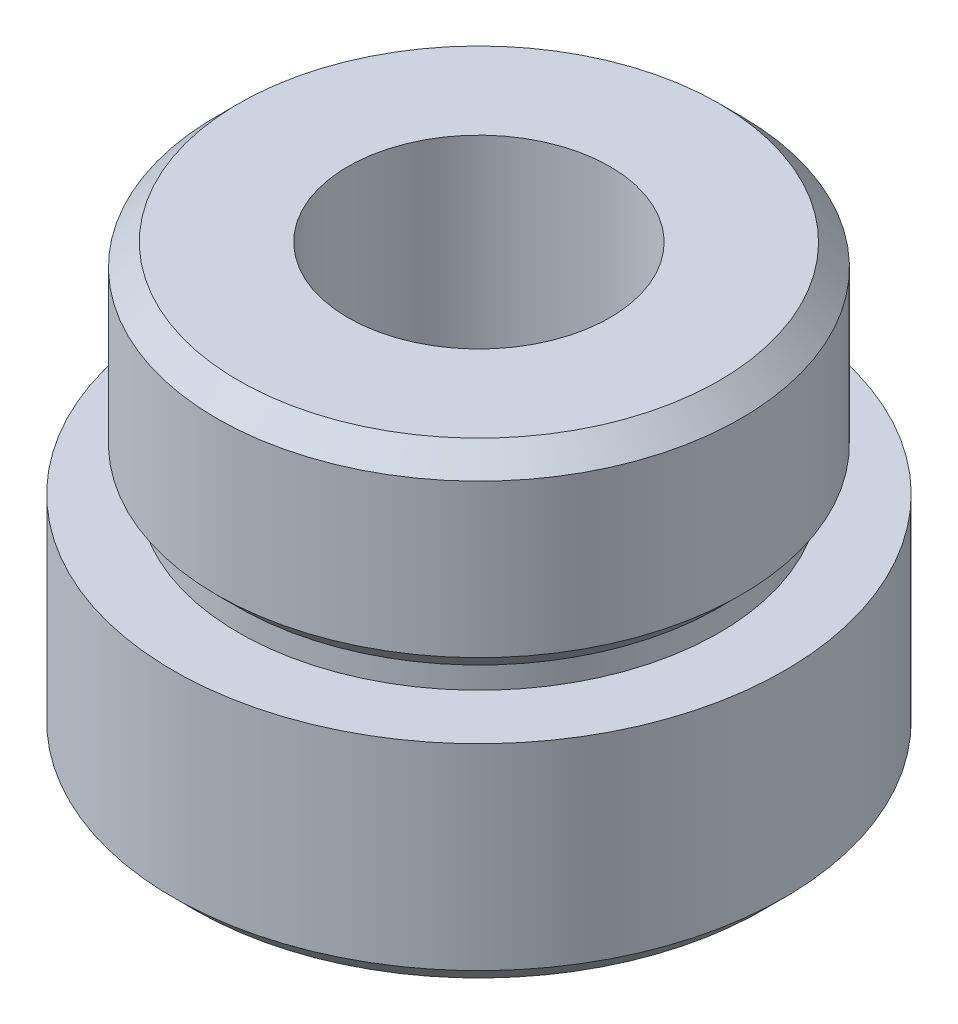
ISO-10303-21;
HEADER;
FILE_DESCRIPTION(('STEP AP214'),'2;1');
FILE_NAME('part.step','',(''),(''),'','','');
FILE_SCHEMA(('AUTOMOTIVE_DESIGN { 1 0 10303 214 1 1 1 1 }'));
ENDSEC;
DATA;
#1=APPLICATION_CONTEXT('core data for automotive mechanical design processes');
#2=APPLICATION_PROTOCOL_DEFINITION('international standard','automotive_design',2000,#1);
#3=PRODUCT_CONTEXT('',#1,'mechanical');
#4=PRODUCT('Part','Part','',(#3));
#5=PRODUCT_RELATED_PRODUCT_CATEGORY('part','',(#4));
#6=PRODUCT_DEFINITION_FORMATION('','',#4);
#7=PRODUCT_DEFINITION_CONTEXT('part definition',#1,'design');
#8=PRODUCT_DEFINITION('design','',#6,#7);
#9=PRODUCT_DEFINITION_SHAPE('','',#8);
#10=(LENGTH_UNIT() NAMED_UNIT(*) SI_UNIT(.MILLI.,.METRE.));
#11=(NAMED_UNIT(*) PLANE_ANGLE_UNIT() SI_UNIT($,.RADIAN.));
#12=(NAMED_UNIT(*) SI_UNIT($,.STERADIAN.) SOLID_ANGLE_UNIT());
#13=UNCERTAINTY_MEASURE_WITH_UNIT(LENGTH_MEASURE(1.E-05),#10,'distance_accuracy_value','');
#14=(GEOMETRIC_REPRESENTATION_CONTEXT(3) GLOBAL_UNCERTAINTY_ASSIGNED_CONTEXT((#13)) GLOBAL_UNIT_ASSIGNED_CONTEXT((#10,
#11,#12)) REPRESENTATION_CONTEXT('',''));
#15=CARTESIAN_POINT('',(0.,0.,0.));
#16=DIRECTION('',(0.,0.,1.));
#17=DIRECTION('',(1.,0.,0.));
#18=AXIS2_PLACEMENT_3D('',#15,#16,#17);
#19=CARTESIAN_POINT('',(0.,2.28857833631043,0.));
#20=DIRECTION('',(0.,1.,0.));
#21=DIRECTION('',(0.,0.,1.));
#22=AXIS2_PLACEMENT_3D('',#19,#20,#21);
#23=CONICAL_SURFACE('',#22,7.,0.785398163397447);
#24=CARTESIAN_POINT('',(0.,1.78857833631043,0.));
#25=DIRECTION('',(0.,-1.,0.));
#26=DIRECTION('',(0.,0.,-1.));
#27=AXIS2_PLACEMENT_3D('',#24,#25,#26);
#28=CIRCLE('',#27,6.5);
#29=CARTESIAN_POINT('',(0.,1.78857833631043,-6.5));
#30=VERTEX_POINT('',#29);
#31=EDGE_CURVE('E65',#30,#30,#28,.T.);
#32=ORIENTED_EDGE('',*,*,#31,.F.);
#33=EDGE_LOOP('',(#32));
#34=FACE_BOUND('',#33,.T.);
#35=CARTESIAN_POINT('',(0.,2.28857833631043,0.));
#36=DIRECTION('',(0.,-1.,0.));
#37=DIRECTION('',(0.,0.,-1.));
#38=AXIS2_PLACEMENT_3D('',#35,#36,#37);
#39=CIRCLE('',#38,7.);
#40=CARTESIAN_POINT('',(0.,2.28857833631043,-7.));
#41=VERTEX_POINT('',#40);
#42=EDGE_CURVE('E10',#41,#41,#39,.T.);
#43=ORIENTED_EDGE('',*,*,#42,.T.);
#44=EDGE_LOOP('',(#43));
#45=FACE_BOUND('',#44,.T.);
#46=ADVANCED_FACE('F31',(#34,#45),#23,.T.);
#47=CARTESIAN_POINT('',(0.,0.,0.));
#48=DIRECTION('',(0.,-1.,0.));
#49=DIRECTION('',(0.,0.,-1.));
#50=AXIS2_PLACEMENT_3D('',#47,#48,#49);
#51=CYLINDRICAL_SURFACE('',#50,7.);
#52=ORIENTED_EDGE('',*,*,#42,.F.);
#53=EDGE_LOOP('',(#52));
#54=FACE_BOUND('',#53,.T.);
#55=CARTESIAN_POINT('',(0.,6.78857833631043,0.));
#56=DIRECTION('',(0.,-1.,0.));
#57=DIRECTION('',(0.,0.,-1.));
#58=AXIS2_PLACEMENT_3D('',#55,#56,#57);
#59=CIRCLE('',#58,7.);
#60=CARTESIAN_POINT('',(0.,6.78857833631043,-7.));
#61=VERTEX_POINT('',#60);
#62=EDGE_CURVE('E37',#61,#61,#59,.T.);
#63=ORIENTED_EDGE('',*,*,#62,.T.);
#64=EDGE_LOOP('',(#63));
#65=FACE_BOUND('',#64,.T.);
#66=ADVANCED_FACE('F72',(#54,#65),#51,.T.);
#67=CARTESIAN_POINT('',(-7.,6.78857833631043,0.));
#68=DIRECTION('',(0.,-1.,0.));
#69=DIRECTION('',(0.,0.,-1.));
#70=AXIS2_PLACEMENT_3D('',#67,#68,#69);
#71=PLANE('',#70);
#72=ORIENTED_EDGE('',*,*,#62,.F.);
#73=EDGE_LOOP('',(#72));
#74=FACE_BOUND('',#73,.T.);
#75=CARTESIAN_POINT('',(0.,6.78857833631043,0.));
#76=DIRECTION('',(0.,-1.,0.));
#77=DIRECTION('',(0.,0.,-1.));
#78=AXIS2_PLACEMENT_3D('',#75,#76,#77);
#79=CIRCLE('',#78,5.5);
#80=CARTESIAN_POINT('',(0.,6.78857833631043,-5.5));
#81=VERTEX_POINT('',#80);
#82=EDGE_CURVE('E41',#81,#81,#79,.T.);
#83=ORIENTED_EDGE('',*,*,#82,.T.);
#84=EDGE_LOOP('',(#83));
#85=FACE_BOUND('',#84,.T.);
#86=ADVANCED_FACE('F76',(#74,#85),#71,.F.);
#87=CARTESIAN_POINT('',(0.,0.,0.));
#88=DIRECTION('',(0.,-1.,0.));
#89=DIRECTION('',(0.,0.,-1.));
#90=AXIS2_PLACEMENT_3D('',#87,#88,#89);
#91=CYLINDRICAL_SURFACE('',#90,5.5);
#92=ORIENTED_EDGE('',*,*,#82,.F.);
#93=EDGE_LOOP('',(#92));
#94=FACE_BOUND('',#93,.T.);
#95=CARTESIAN_POINT('',(0.,7.28857833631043,0.));
#96=DIRECTION('',(0.,-1.,0.));
#97=DIRECTION('',(0.,0.,-1.));
#98=AXIS2_PLACEMENT_3D('',#95,#96,#97);
#99=CIRCLE('',#98,5.5);
#100=CARTESIAN_POINT('',(0.,7.28857833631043,-5.5));
#101=VERTEX_POINT('',#100);
#102=EDGE_CURVE('E45',#101,#101,#99,.T.);
#103=ORIENTED_EDGE('',*,*,#102,.T.);
#104=EDGE_LOOP('',(#103));
#105=FACE_BOUND('',#104,.T.);
#106=ADVANCED_FACE('F81',(#94,#105),#91,.T.);
#107=CARTESIAN_POINT('',(0.,7.78857833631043,0.));
#108=DIRECTION('',(0.,1.,0.));
#109=DIRECTION('',(0.,0.,1.));
#110=AXIS2_PLACEMENT_3D('',#107,#108,#109);
#111=CONICAL_SURFACE('',#110,6.,0.785398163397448);
#112=ORIENTED_EDGE('',*,*,#102,.F.);
#113=EDGE_LOOP('',(#112));
#114=FACE_BOUND('',#113,.T.);
#115=CARTESIAN_POINT('',(0.,7.78857833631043,0.));
#116=DIRECTION('',(0.,-1.,0.));
#117=DIRECTION('',(0.,0.,-1.));
#118=AXIS2_PLACEMENT_3D('',#115,#116,#117);
#119=CIRCLE('',#118,6.);
#120=CARTESIAN_POINT('',(0.,7.78857833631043,-6.));
#121=VERTEX_POINT('',#120);
#122=EDGE_CURVE('E50',#121,#121,#119,.T.);
#123=ORIENTED_EDGE('',*,*,#122,.T.);
#124=EDGE_LOOP('',(#123));
#125=FACE_BOUND('',#124,.T.);
#126=ADVANCED_FACE('F87',(#114,#125),#111,.T.);
#127=CARTESIAN_POINT('',(0.,0.,0.));
#128=DIRECTION('',(0.,-1.,0.));
#129=DIRECTION('',(0.,0.,-1.));
#130=AXIS2_PLACEMENT_3D('',#127,#128,#129);
#131=CYLINDRICAL_SURFACE('',#130,6.);
#132=ORIENTED_EDGE('',*,*,#122,.F.);
#133=EDGE_LOOP('',(#132));
#134=FACE_BOUND('',#133,.T.);
#135=CARTESIAN_POINT('',(0.,11.2885783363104,0.));
#136=DIRECTION('',(0.,-1.,0.));
#137=DIRECTION('',(0.,0.,-1.));
#138=AXIS2_PLACEMENT_3D('',#135,#136,#137);
#139=CIRCLE('',#138,6.);
#140=CARTESIAN_POINT('',(0.,11.2885783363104,-6.));
#141=VERTEX_POINT('',#140);
#142=EDGE_CURVE('E53',#141,#141,#139,.T.);
#143=ORIENTED_EDGE('',*,*,#142,.T.);
#144=EDGE_LOOP('',(#143));
#145=FACE_BOUND('',#144,.T.);
#146=ADVANCED_FACE('F91',(#134,#145),#131,.T.);
#147=CARTESIAN_POINT('',(0.,11.7885783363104,0.));
#148=DIRECTION('',(0.,-1.,0.));
#149=DIRECTION('',(0.,0.,-1.));
#150=AXIS2_PLACEMENT_3D('',#147,#148,#149);
#151=CONICAL_SURFACE('',#150,5.5,0.785398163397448);
#152=ORIENTED_EDGE('',*,*,#142,.F.);
#153=EDGE_LOOP('',(#152));
#154=FACE_BOUND('',#153,.T.);
#155=CARTESIAN_POINT('',(0.,11.7885783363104,0.));
#156=DIRECTION('',(0.,-1.,0.));
#157=DIRECTION('',(0.,0.,-1.));
#158=AXIS2_PLACEMENT_3D('',#155,#156,#157);
#159=CIRCLE('',#158,5.5);
#160=CARTESIAN_POINT('',(0.,11.7885783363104,-5.5));
#161=VERTEX_POINT('',#160);
#162=EDGE_CURVE('E56',#161,#161,#159,.T.);
#163=ORIENTED_EDGE('',*,*,#162,.T.);
#164=EDGE_LOOP('',(#163));
#165=FACE_BOUND('',#164,.T.);
#166=ADVANCED_FACE('F95',(#154,#165),#151,.T.);
#167=CARTESIAN_POINT('',(-5.5,11.7885783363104,0.));
#168=DIRECTION('',(0.,-1.,0.));
#169=DIRECTION('',(0.,0.,-1.));
#170=AXIS2_PLACEMENT_3D('',#167,#168,#169);
#171=PLANE('',#170);
#172=ORIENTED_EDGE('',*,*,#162,.F.);
#173=EDGE_LOOP('',(#172));
#174=FACE_BOUND('',#173,.T.);
#175=CARTESIAN_POINT('',(0.,11.7885783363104,0.));
#176=DIRECTION('',(0.,-1.,0.));
#177=DIRECTION('',(0.,0.,-1.));
#178=AXIS2_PLACEMENT_3D('',#175,#176,#177);
#179=CIRCLE('',#178,3.);
#180=CARTESIAN_POINT('',(0.,11.7885783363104,-3.));
#181=VERTEX_POINT('',#180);
#182=EDGE_CURVE('E59',#181,#181,#179,.T.);
#183=ORIENTED_EDGE('',*,*,#182,.T.);
#184=EDGE_LOOP('',(#183));
#185=FACE_BOUND('',#184,.T.);
#186=ADVANCED_FACE('F99',(#174,#185),#171,.F.);
#187=CARTESIAN_POINT('',(0.,0.,0.));
#188=DIRECTION('',(0.,-1.,0.));
#189=DIRECTION('',(0.,0.,-1.));
#190=AXIS2_PLACEMENT_3D('',#187,#188,#189);
#191=CYLINDRICAL_SURFACE('',#190,3.);
#192=ORIENTED_EDGE('',*,*,#182,.F.);
#193=EDGE_LOOP('',(#192));
#194=FACE_BOUND('',#193,.T.);
#195=CARTESIAN_POINT('',(0.,1.78857833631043,0.));
#196=DIRECTION('',(0.,-1.,0.));
#197=DIRECTION('',(0.,0.,-1.));
#198=AXIS2_PLACEMENT_3D('',#195,#196,#197);
#199=CIRCLE('',#198,3.);
#200=CARTESIAN_POINT('',(0.,1.78857833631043,-3.));
#201=VERTEX_POINT('',#200);
#202=EDGE_CURVE('E62',#201,#201,#199,.T.);
#203=ORIENTED_EDGE('',*,*,#202,.T.);
#204=EDGE_LOOP('',(#203));
#205=FACE_BOUND('',#204,.T.);
#206=ADVANCED_FACE('F103',(#194,#205),#191,.F.);
#207=CARTESIAN_POINT('',(-3.,1.78857833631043,0.));
#208=DIRECTION('',(0.,1.,0.));
#209=DIRECTION('',(0.,0.,1.));
#210=AXIS2_PLACEMENT_3D('',#207,#208,#209);
#211=PLANE('',#210);
#212=ORIENTED_EDGE('',*,*,#202,.F.);
#213=EDGE_LOOP('',(#212));
#214=FACE_BOUND('',#213,.T.);
#215=ORIENTED_EDGE('',*,*,#31,.T.);
#216=EDGE_LOOP('',(#215));
#217=FACE_BOUND('',#216,.T.);
#218=ADVANCED_FACE('F69',(#214,#217),#211,.F.);
#219=CLOSED_SHELL('',(#46,#66,#86,#106,#126,#146,#166,#186,#206,#218));
#220=MANIFOLD_SOLID_BREP('B2',#219);
#221=ADVANCED_BREP_SHAPE_REPRESENTATION('',(#18,#220),#14);
#222=SHAPE_DEFINITION_REPRESENTATION(#9,#221);
ENDSEC;
END-ISO-10303-21;
